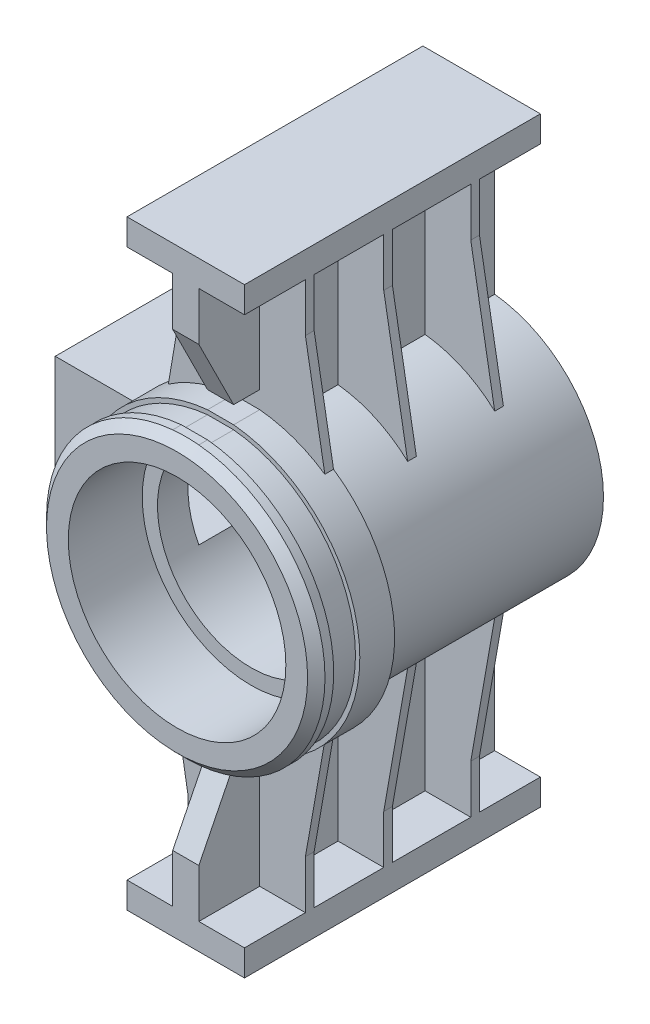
from build123d import *

# Parameters (mm, degrees)
ESQUISSE1_R                     = 16
BASE_EXTRUSION_DEPTH            = 35
CHANFREIN1_SIZE                 = 1
ESQUISSE2_R                     = 26.5
ESQUISSE2_R_2                   = 15.5
ENL_V_DE_MAT_EXTRU_MINCE1_DEPTH = 3
ESQUISSE3_R                     = 25
ESQUISSE3_R_2                   = 14
ENL_V_DE_MAT_EXTRU_MINCE2_DEPTH = 33
ESQUISSE4_W                     = 16
ESQUISSE4_H                     = 17
BOSS_EXTRU_1_DEPTH              = 26
BOSS_EXTRU_2_DEPTH              = 34
BOSS_EXTRU_3_DEPTH              = 34
ENL_V_MAT_EXTRU_2_DEPTH         = 10
ENL_V_MAT_EXTRU_3_DEPTH         = 10
BOSS_EXTRU_4_DEPTH              = 1
BOSS_EXTRU_5_DEPTH              = 1
BOSS_EXTRU_6_DEPTH              = 1
ESQUISSE17_W                    = 10.49668325
ESQUISSE17_H                    = 11
ENL_V_MAT_EXTRU_4_DEPTH         = 23
ESQUISSE18_R                    = 10.75
ENL_V_MAT_EXTRU_5_DEPTH         = 53
ESQUISSE19_R                    = 12.5
ENL_V_MAT_EXTRU_6_DEPTH         = 8.5


with BuildPart() as part:
    # Esquisse1 → Base-Extrusion (new body)
    with BuildSketch(Plane.XY):
        Circle(ESQUISSE1_R)
    extrude(amount=BASE_EXTRUSION_DEPTH)

    # Chanfrein1
    chanfrein1_edges = [part.edges().sort_by_distance(p)[0] for p in [
        (-16, 0, 35),
    ]]
    chamfer(chanfrein1_edges, length=CHANFREIN1_SIZE)

    # Esquisse2 → Enl_v. de mat.-Extru.-Mince1 (cut)
    with BuildSketch(Plane.XY.offset(33)):
        Circle(ESQUISSE2_R)
        Circle(ESQUISSE2_R_2, mode=Mode.SUBTRACT)
    extrude(amount=-ENL_V_DE_MAT_EXTRU_MINCE1_DEPTH, mode=Mode.SUBTRACT)

    # Esquisse3 → Enl_v. de mat.-Extru.-Mince2 (cut)
    with BuildSketch(Plane.XY.offset(26)):
        Circle(ESQUISSE3_R)
        Circle(ESQUISSE3_R_2, mode=Mode.SUBTRACT)
    extrude(amount=-ENL_V_DE_MAT_EXTRU_MINCE2_DEPTH, mode=Mode.SUBTRACT)

    # Esquisse4 → Boss.-Extru.1 (add)
    with BuildSketch(Plane.XY.offset(26)):
        with Locations((-15, 0)):
            Rectangle(ESQUISSE4_W, ESQUISSE4_H)
    extrude(amount=-BOSS_EXTRU_1_DEPTH)

    # Esquisse5 → Boss.-Extru.2 (add)
    with BuildSketch(Plane(origin=(0, 0, 0), x_dir=(-1, 0, 0), z_dir=(0, 0, -1))):
        Polygon((1.5, -31.5), (1.5, -12.798686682), (-1.5, -12.798686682), (-1.5, -31.5), (-6.75, -31.5), (-6.75, -34.5), (6.75, -34.5), (6.75, -31.5), align=None)
    extrude(amount=-BOSS_EXTRU_2_DEPTH)

    # Esquisse9 → Boss.-Extru.3 (add)
    with BuildSketch(Plane(origin=(0, 0, 0), x_dir=(-1, 0, 0), z_dir=(0, 0, -1))):
        Polygon((-1.5, 12.767770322), (-1.5, 31.5), (-6.75, 31.5), (-6.75, 34.5), (6.75, 34.5), (6.75, 31.5), (1.5, 31.5), (1.5, 12.767770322), align=None)
    extrude(amount=-BOSS_EXTRU_3_DEPTH)

    # Esquisse11 → Enl_v. mat.-Extru.2 (cut)
    with BuildSketch(Plane.ZY.offset(1.5)):
        Polygon((34, 15.929532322), (33, 15.929532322), (33, 15.427248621), (30, 15.427248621), (30, 15.929532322), (26, 15.929532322), (26, 17.929532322), (30, 17.929532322), (34, 25.929532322), align=None)
    extrude(amount=-ENL_V_MAT_EXTRU_2_DEPTH, mode=Mode.SUBTRACT)

    # Esquisse12 → Enl_v. mat.-Extru.3 (cut)
    with BuildSketch(Plane.ZY.offset(1.5)):
        Polygon((34, -15.929532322), (33, -15.929532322), (33, -15.427248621), (30, -15.427248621), (30, -15.929532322), (26, -15.929532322), (26, -17.929532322), (30, -17.929532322), (34, -25.929532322), align=None)
    extrude(amount=-ENL_V_MAT_EXTRU_3_DEPTH, mode=Mode.SUBTRACT)

    # Esquisse13 → Boss.-Extru.4 (add)
    with BuildSketch(Plane(origin=(0, 0, 8), x_dir=(-1, 0, 0), z_dir=(0, 0, -1))):
        Polygon((-6.75, 31.5), (-6.75, 25.929532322), (-9.5, 10.283481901), (9.5, 10.283481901), (6.75, 26.5), (6.75, 31.5), align=None)
        Polygon((9.5, -10.283481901), (6.75, -26.5), (6.75, -31.5), (-6.75, -31.5), (-6.75, -25.929532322), (-9.5, -10.283481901), align=None)
    extrude(amount=BOSS_EXTRU_4_DEPTH)

    # Esquisse14 → Boss.-Extru.5 (add)
    with BuildSketch(Plane(origin=(0, 0, 17), x_dir=(-1, 0, 0), z_dir=(0, 0, -1))):
        Polygon((6.75, 31.5), (-6.75, 31.5), (-6.75, 25.929532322), (-9.5, 10.283481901), (9.5, 10.283481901), (6.75, 26.5), align=None)
        Polygon((6.75, -26.5), (6.75, -31.5), (-6.75, -31.5), (-6.75, -25.929532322), (-9.5, -10.283481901), (9.5, -10.283481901), align=None)
    extrude(amount=-BOSS_EXTRU_5_DEPTH)

    # Esquisse16 → Boss.-Extru.6 (add)
    with BuildSketch(Plane(origin=(0, 0, 27), x_dir=(-1, 0, 0), z_dir=(0, 0, -1))):
        Polygon((-6.75, -31.5), (6.75, -31.5), (6.75, -26.5), (9.5, -10.283481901), (-9.5, -10.283481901), (-6.75, -25.929532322), align=None)
        Polygon((-9.5, 10.283481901), (-6.75, 25.929532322), (-6.75, 31.5), (6.75, 31.5), (6.75, 26.5), (9.5, 10.283481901), align=None)
    extrude(amount=BOSS_EXTRU_6_DEPTH)

    # Esquisse17 → Enl_v. mat.-Extru.4 (cut)
    with BuildSketch(Plane(origin=(0, 0, 0), x_dir=(-1, 0, 0), z_dir=(0, 0, -1))):
        with Locations((14.748341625, 0)):
            Rectangle(ESQUISSE17_W, ESQUISSE17_H)
    extrude(amount=-ENL_V_MAT_EXTRU_4_DEPTH, mode=Mode.SUBTRACT)

    # Esquisse18 → Enl_v. mat.-Extru.5 (cut)
    with BuildSketch(Plane(origin=(0, 0, 0), x_dir=(-1, 0, 0), z_dir=(0, 0, -1))):
        with Locations(Location((0, 0, 0), (0, 0, 332.094527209))):
            Circle(ESQUISSE18_R)
    extrude(amount=-ENL_V_MAT_EXTRU_5_DEPTH, mode=Mode.SUBTRACT)

    # Esquisse19 → Enl_v. mat.-Extru.6 (cut)
    with BuildSketch(Plane.XY.offset(35)):
        Circle(ESQUISSE19_R)
    extrude(amount=-ENL_V_MAT_EXTRU_6_DEPTH, mode=Mode.SUBTRACT)


solid = part.part
